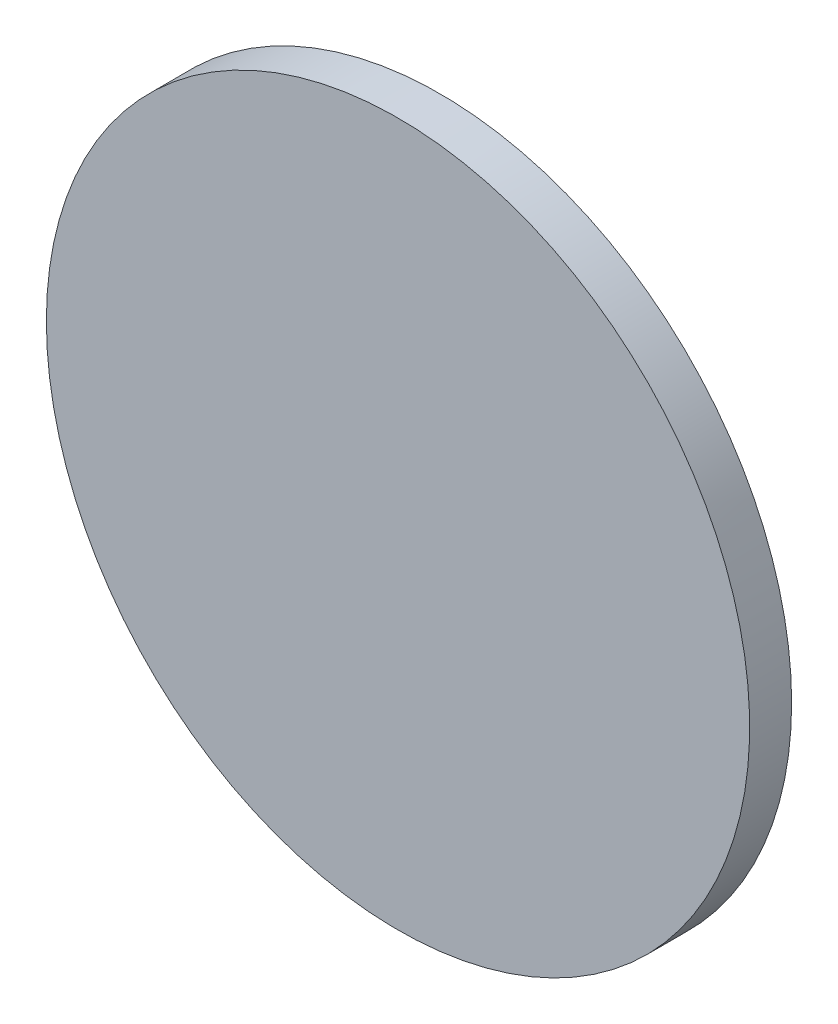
ISO-10303-21;
HEADER;
FILE_DESCRIPTION(('STEP AP214'),'2;1');
FILE_NAME('part.step','',(''),(''),'','','');
FILE_SCHEMA(('AUTOMOTIVE_DESIGN { 1 0 10303 214 1 1 1 1 }'));
ENDSEC;
DATA;
#1=APPLICATION_CONTEXT('core data for automotive mechanical design processes');
#2=APPLICATION_PROTOCOL_DEFINITION('international standard','automotive_design',2000,#1);
#3=PRODUCT_CONTEXT('',#1,'mechanical');
#4=PRODUCT('Part','Part','',(#3));
#5=PRODUCT_RELATED_PRODUCT_CATEGORY('part','',(#4));
#6=PRODUCT_DEFINITION_FORMATION('','',#4);
#7=PRODUCT_DEFINITION_CONTEXT('part definition',#1,'design');
#8=PRODUCT_DEFINITION('design','',#6,#7);
#9=PRODUCT_DEFINITION_SHAPE('','',#8);
#10=(LENGTH_UNIT() NAMED_UNIT(*) SI_UNIT(.MILLI.,.METRE.));
#11=(NAMED_UNIT(*) PLANE_ANGLE_UNIT() SI_UNIT($,.RADIAN.));
#12=(NAMED_UNIT(*) SI_UNIT($,.STERADIAN.) SOLID_ANGLE_UNIT());
#13=UNCERTAINTY_MEASURE_WITH_UNIT(LENGTH_MEASURE(1.E-05),#10,'distance_accuracy_value','');
#14=(GEOMETRIC_REPRESENTATION_CONTEXT(3) GLOBAL_UNCERTAINTY_ASSIGNED_CONTEXT((#13)) GLOBAL_UNIT_ASSIGNED_CONTEXT((#10,
#11,#12)) REPRESENTATION_CONTEXT('',''));
#15=CARTESIAN_POINT('',(0.,0.,0.));
#16=DIRECTION('',(0.,0.,1.));
#17=DIRECTION('',(1.,0.,0.));
#18=AXIS2_PLACEMENT_3D('',#15,#16,#17);
#19=CARTESIAN_POINT('',(0.,0.,42.));
#20=DIRECTION('',(0.,0.,-1.));
#21=DIRECTION('',(1.,0.,0.));
#22=AXIS2_PLACEMENT_3D('',#19,#20,#21);
#23=SPHERICAL_SURFACE('',#22,51.7);
#24=CARTESIAN_POINT('',(0.,0.,-3.03032311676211));
#25=DIRECTION('',(0.,0.,-1.));
#26=DIRECTION('',(-1.,0.,0.));
#27=AXIS2_PLACEMENT_3D('',#24,#25,#26);
#28=CIRCLE('',#27,25.4);
#29=CARTESIAN_POINT('',(-25.4,0.,-3.03032311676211));
#30=VERTEX_POINT('',#29);
#31=EDGE_CURVE('E10',#30,#30,#28,.T.);
#32=ORIENTED_EDGE('',*,*,#31,.T.);
#33=EDGE_LOOP('',(#32));
#34=FACE_BOUND('',#33,.T.);
#35=ADVANCED_FACE('F32',(#34),#23,.T.);
#36=CARTESIAN_POINT('',(0.,0.,0.));
#37=DIRECTION('',(0.,0.,-1.));
#38=DIRECTION('',(-1.,0.,0.));
#39=AXIS2_PLACEMENT_3D('',#36,#37,#38);
#40=CYLINDRICAL_SURFACE('',#39,25.4);
#41=CARTESIAN_POINT('',(0.,0.,0.));
#42=DIRECTION('',(0.,0.,-1.));
#43=DIRECTION('',(-1.,0.,0.));
#44=AXIS2_PLACEMENT_3D('',#41,#42,#43);
#45=CIRCLE('',#44,25.4);
#46=CARTESIAN_POINT('',(-25.4,0.,0.));
#47=VERTEX_POINT('',#46);
#48=EDGE_CURVE('E38',#47,#47,#45,.T.);
#49=ORIENTED_EDGE('',*,*,#48,.T.);
#50=EDGE_LOOP('',(#49));
#51=FACE_BOUND('',#50,.T.);
#52=ORIENTED_EDGE('',*,*,#31,.F.);
#53=EDGE_LOOP('',(#52));
#54=FACE_BOUND('',#53,.T.);
#55=ADVANCED_FACE('F44',(#51,#54),#40,.T.);
#56=CARTESIAN_POINT('',(0.,0.,0.));
#57=DIRECTION('',(0.,0.,1.));
#58=DIRECTION('',(1.,0.,0.));
#59=AXIS2_PLACEMENT_3D('',#56,#57,#58);
#60=PLANE('',#59);
#61=ORIENTED_EDGE('',*,*,#48,.F.);
#62=EDGE_LOOP('',(#61));
#63=FACE_BOUND('',#62,.T.);
#64=ADVANCED_FACE('F47',(#63),#60,.T.);
#65=CLOSED_SHELL('',(#35,#55,#64));
#66=MANIFOLD_SOLID_BREP('B2',#65);
#67=ADVANCED_BREP_SHAPE_REPRESENTATION('',(#18,#66),#14);
#68=SHAPE_DEFINITION_REPRESENTATION(#9,#67);
ENDSEC;
END-ISO-10303-21;
